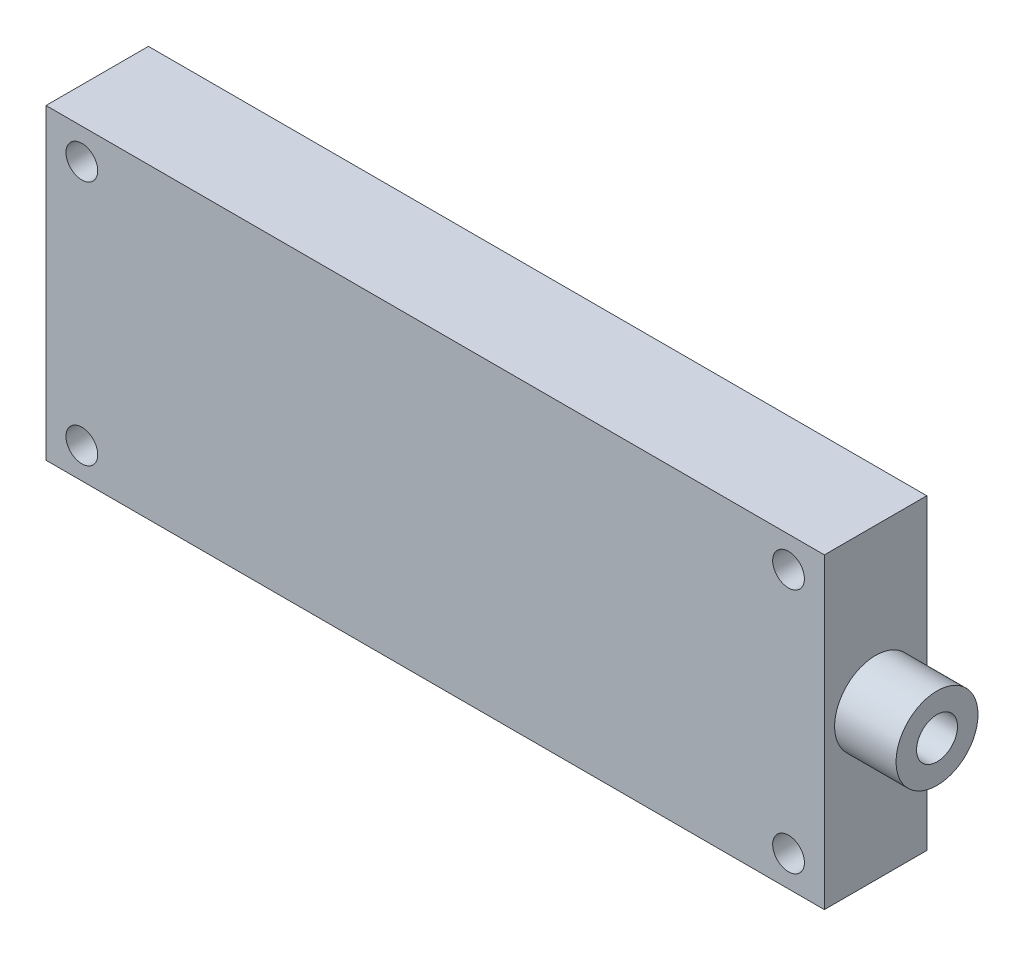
from build123d import *

# Parameters (mm, degrees)
SKETCH_1_W          = 76
SKETCH_1_H          = 30
EXTRUDE_1_DEPTH     = 10
SKETCH_2_R          = 1.55
CUT_EXTRUDE_1_DEPTH = 3
SKETCH_3_R          = 4
EXTRUDE_2_DEPTH     = 6
SKETCH_4_R          = 2
CUT_EXTRUDE_2_DEPTH = 1.5
CUT_EXTRUDE_3_DEPTH = 7


with BuildPart() as part:
    # Sketch 1 → Extrude 1 (new body)
    with BuildSketch(Plane.XY):
        with Locations((38, 15)):
            Rectangle(SKETCH_1_W, SKETCH_1_H)
    extrude(amount=EXTRUDE_1_DEPTH)

    # Sketch 2 → Cut-Extrude 1 (cut)
    with BuildSketch(Plane.XY.offset(10)):
        with Locations((3.5, 27)):
            Circle(SKETCH_2_R)
        with Locations((3.5, 3)):
            Circle(SKETCH_2_R)
        with Locations((72.5, 3)):
            Circle(SKETCH_2_R)
        with Locations((72.5, 27)):
            Circle(SKETCH_2_R)
    extrude(amount=-CUT_EXTRUDE_1_DEPTH, mode=Mode.SUBTRACT)

    # Sketch 3 → Extrude 2 (add)
    with BuildSketch(Plane(origin=(76, 0, 0), x_dir=(0, 0, -1), z_dir=(1, 0, 0))):
        with Locations((-5, 15)):
            Circle(SKETCH_3_R)
    extrude(amount=EXTRUDE_2_DEPTH)

    # Sketch 4 → Cut-Extrude 2 (cut)
    with BuildSketch(Plane(origin=(82, 0, 0), x_dir=(0, 0, -1), z_dir=(1, 0, 0))):
        with Locations((-5, 15)):
            Circle(SKETCH_4_R)
    extrude(amount=-CUT_EXTRUDE_2_DEPTH, mode=Mode.SUBTRACT)

    # Sketch 5 → Cut-Extrude 3 (cut)
    with BuildSketch(Plane(origin=(80.5, 0, 0), x_dir=(0, 0, -1), z_dir=(1, 0, 0))):
        with BuildLine():
            Line((-6.322875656, 16.5), (-3.677124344, 16.5))
            ThreePointArc((-3.677124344, 16.5), (-5, 13), (-6.322875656, 16.5))
        make_face()
    extrude(amount=-CUT_EXTRUDE_3_DEPTH, mode=Mode.SUBTRACT)


solid = part.part
